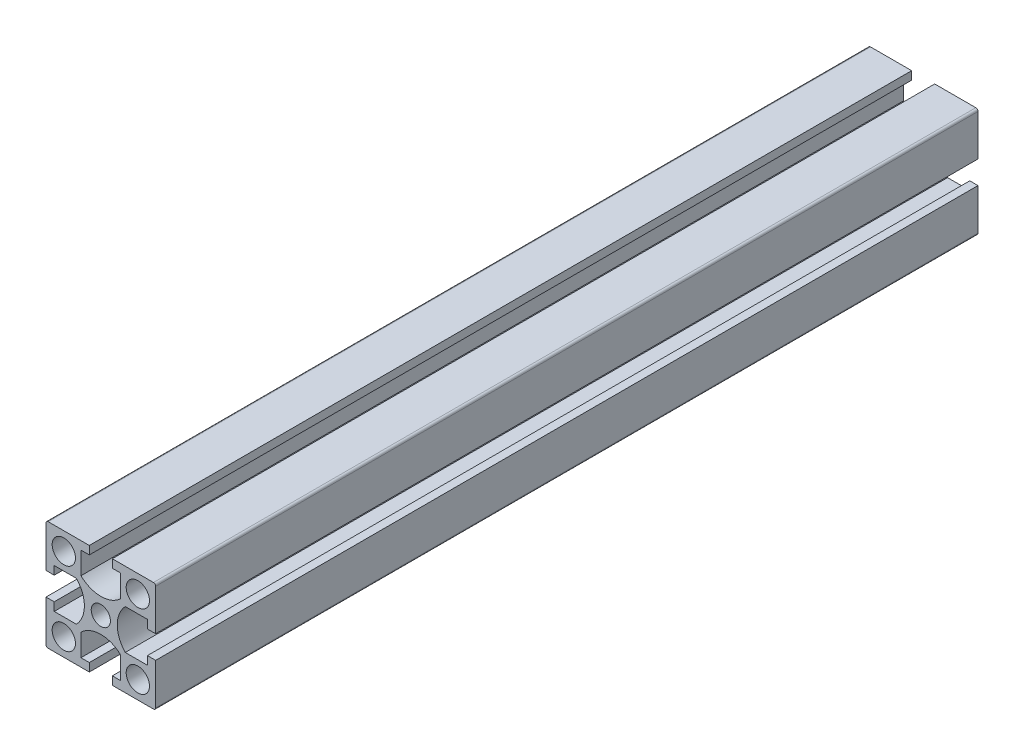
from build123d import *

# Parameters (mm, degrees)
SKETCH_1_R      = 4.25
EXTRUDE_1_DEPTH = 150


with BuildPart() as part:
    # Sketch 1 → Extrude 1 (new, symmetric)
    with BuildSketch(Plane.XY):
        with BuildLine():
            Line((-17, 7.25), (-8.904771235, 7.25))
            ThreePointArc((-8.904771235, 7.25), (-6, 0), (-8.904771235, -7.25))
            Line((-8.904771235, -7.25), (-17, -7.25))
            Line((-17, -7.25), (-17, -4.2))
            Line((-17, -4.2), (-20, -4.2))
            Line((-20, -4.2), (-20, -19.2))
            ThreePointArc((-20, -19.2), (-19.765685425, -19.765685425), (-19.2, -20))
            Line((-19.2, -20), (-4.2, -20))
            Line((-4.2, -20), (-4.2, -17))
            Line((-4.2, -17), (-7.25, -17))
            Line((-7.25, -17), (-7.25, -8.904771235))
            ThreePointArc((-7.25, -8.904771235), (0, -6), (7.25, -8.904771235))
            Line((7.25, -8.904771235), (7.25, -17))
            Line((7.25, -17), (4.2, -17))
            Line((4.2, -17), (4.2, -20))
            Line((4.2, -20), (19.2, -20))
            ThreePointArc((19.2, -20), (19.765685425, -19.765685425), (20, -19.2))
            Line((20, -19.2), (20, -4.2))
            Line((20, -4.2), (17, -4.2))
            Line((17, -4.2), (17, -7.25))
            Line((17, -7.25), (8.904771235, -7.25))
            ThreePointArc((8.904771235, -7.25), (6, 0), (8.904771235, 7.25))
            Line((8.904771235, 7.25), (17, 7.25))
            Line((17, 7.25), (17, 4.2))
            Line((17, 4.2), (20, 4.2))
            Line((20, 4.2), (20, 19.2))
            ThreePointArc((20, 19.2), (19.765685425, 19.765685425), (19.2, 20))
            Line((19.2, 20), (4.2, 20))
            Line((4.2, 20), (4.2, 17))
            Line((4.2, 17), (7.25, 17))
            Line((7.25, 17), (7.25, 8.904771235))
            ThreePointArc((7.25, 8.904771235), (0, 6), (-7.25, 8.904771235))
            Line((-7.25, 8.904771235), (-7.25, 17))
            Line((-7.25, 17), (-4.2, 17))
            Line((-4.2, 17), (-4.2, 20))
            Line((-4.2, 20), (-19.2, 20))
            ThreePointArc((-19.2, 20), (-19.765685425, 19.765685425), (-20, 19.2))
            Line((-20, 19.2), (-20, 4.2))
            Line((-20, 4.2), (-17, 4.2))
            Line((-17, 4.2), (-17, 7.25))
        make_face()
        with Locations((-13.5, -13.5)):
            Circle(SKETCH_1_R, mode=Mode.SUBTRACT)
        with Locations((13.5, -13.5)):
            Circle(SKETCH_1_R, mode=Mode.SUBTRACT)
        with Locations((-13.5, 13.5)):
            Circle(SKETCH_1_R, mode=Mode.SUBTRACT)
        with Locations((13.5, 13.5)):
            Circle(SKETCH_1_R, mode=Mode.SUBTRACT)
        with BuildLine():
            ThreePointArc((-3.5, 0), (0, -3.5), (3.5, 0))
            ThreePointArc((3.5, 0), (0, 3.5), (-3.5, 0))
        make_face(mode=Mode.SUBTRACT)
    extrude(amount=EXTRUDE_1_DEPTH, both=True)


solid = part.part
